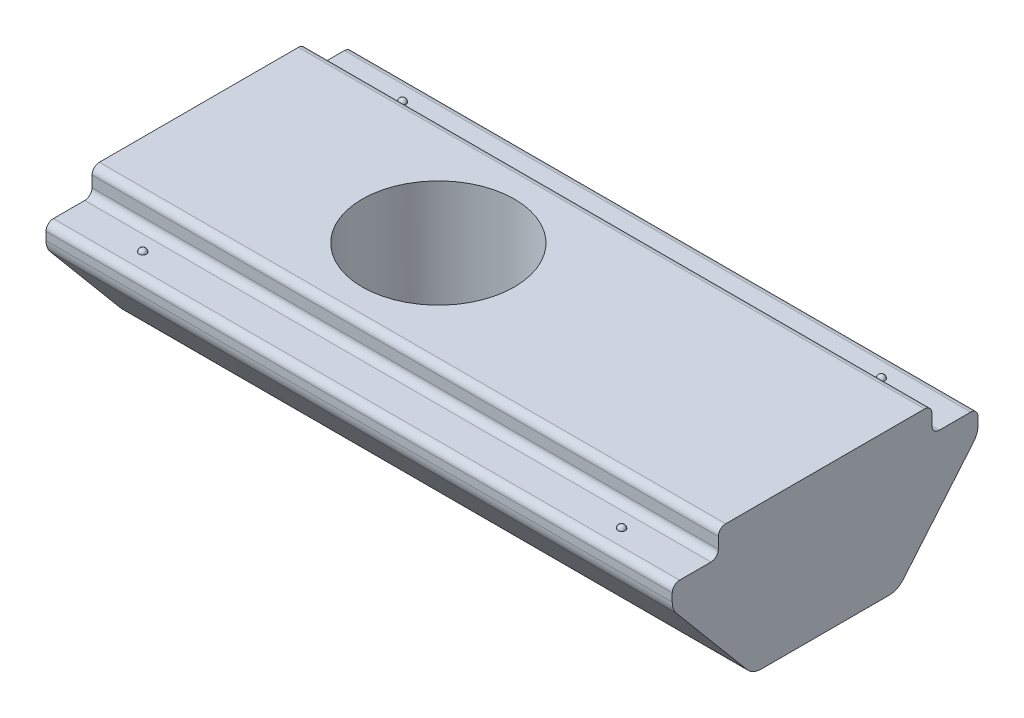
from build123d import *

# Parameters (mm, degrees)
BOSS_EXTRUDE1_DEPTH  = 17
FILLET1_R            = 0.2
FILLET2_R            = 0.5
SKETCH2_W            = 1.75
SKETCH2_H            = 0.95
LPATTERN1_COUNT      = 2
LPATTERN1_PITCH      = 7.05
LPATTERN1_COUNT_DIR2 = 2
LPATTERN1_PITCH_DIR2 = 13
TAP1_D               = 4.134


with BuildPart() as part:
    # Sketch1 → Boss-Extrude1 (new body)
    with BuildSketch(Plane(origin=(-6.5, 0, 0), x_dir=(0, 0, -1), z_dir=(1, 0, 0))):
        Polygon((2.9, 0.7), (-2.9, 0.7), (-2.9, 0), (-4.15, 0), (-4.15, -0.6), (-1.968340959, -3.2), (1.968340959, -3.2), (4.15, -0.6), (4.15, 0), (2.9, 0), align=None)
    extrude(amount=BOSS_EXTRUDE1_DEPTH)

    # Fillet1
    fillet1_edges = [part.edges().sort_by_distance(p)[0] for p in [
        (2, 0, 4.15),
        (2, 0, 2.9),
        (2, 0.7, 2.9),
        (2, 0.7, -2.9),
        (2, 0, -2.9),
        (2, 0, -4.15),
    ]]
    fillet(fillet1_edges, radius=FILLET1_R)

    # Fillet2
    fillet2_edges = [part.edges().sort_by_distance(p)[0] for p in [
        (2, -0.6, -4.15),
        (2, -3.2, -1.968340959),
        (2, -3.2, 1.968340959),
        (2, -0.6, 4.15),
    ]]
    fillet(fillet2_edges, radius=FILLET2_R)

    # Sketch2 → Cut-Revolve1 (revolve, cut)
    with BuildSketch(Plane(origin=(6.5, 0, 0), x_dir=(0, 0, -1), z_dir=(1, 0, 0)), mode=Mode.PRIVATE) as cut_revolve1_sk:
        with Locations((0.875, -2.725)):
            Rectangle(SKETCH2_W, SKETCH2_H)
    revolve(cut_revolve1_sk.sketch.rotate(Axis((6.5, 0, 0), (0, -1, 0)), 180), axis=Axis((6.5, 0, 0), (0, -1, 0)), mode=Mode.SUBTRACT)

    # Sketch3 → Revolve1 (revolve)
    with BuildSketch(Plane(origin=(6.5, 0, 0), x_dir=(0, 0, -1), z_dir=(1, 0, 0))):
        with BuildLine():
            Line((-1.75, -2.25), (0, -2.25))
            Line((0, -2.25), (0, -4))
            ThreePointArc((0, -4), (-1.237436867, -3.487436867), (-1.75, -2.25))
        make_face()
    revolve(axis=Axis((6.5, 0, 0), (0, -1, 0)))

    # Sketch4 → Revolve2 (revolve)
    with BuildSketch(Plane(origin=(-4.5, 0, 0), x_dir=(0, 0, -1), z_dir=(1, 0, 0)), mode=Mode.PRIVATE) as revolve2_sk:
        with BuildLine():
            Line((-3.625, 0), (-3.525, 0))
            Line((-3.525, 0), (-3.525, 0.1))
            ThreePointArc((-3.525, 0.1), (-3.595710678, 0.070710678), (-3.625, 0))
        make_face()
    revolve2 = revolve(revolve2_sk.sketch.rotate(Axis((-4.5, 0.1, 3.525), (0, -1, 0)), 180), axis=Axis((-4.5, 0.1, 3.525), (0, -1, 0)))

    # LPattern1: Revolve2 2 × 2
    with Locations(*[(j * LPATTERN1_PITCH_DIR2, 0, -i * LPATTERN1_PITCH) for i in range(LPATTERN1_COUNT) for j in range(LPATTERN1_COUNT_DIR2) if (i, j) != (0, 0)]):
        add(revolve2)

    # Tap1 (through all)
    with Locations(Plane(origin=(0, 0.7, 0), x_dir=(1, 0, 0), z_dir=(0, 1, 0))):
        with Locations((0, 0)):
            Hole(TAP1_D / 2)


solid = part.part
